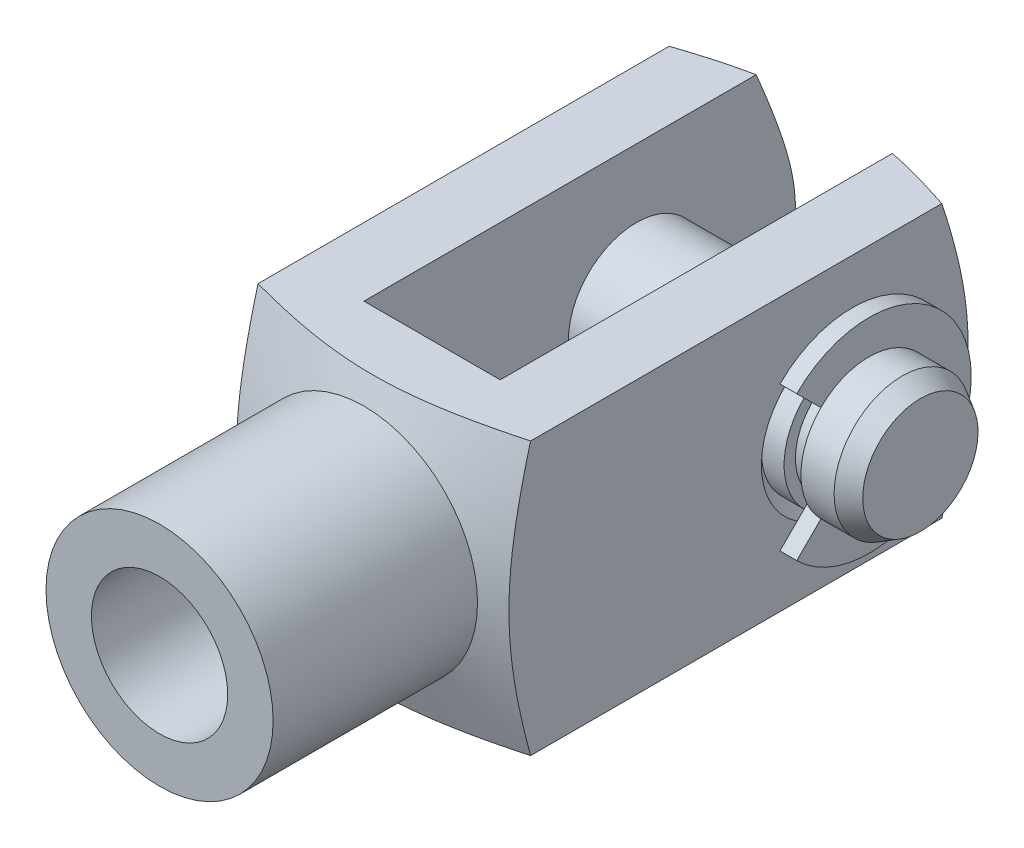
ISO-10303-21;
HEADER;
FILE_DESCRIPTION(('STEP AP214'),'2;1');
FILE_NAME('part.step','',(''),(''),'','','');
FILE_SCHEMA(('AUTOMOTIVE_DESIGN { 1 0 10303 214 1 1 1 1 }'));
ENDSEC;
DATA;
#1=APPLICATION_CONTEXT('core data for automotive mechanical design processes');
#2=APPLICATION_PROTOCOL_DEFINITION('international standard','automotive_design',2000,#1);
#3=PRODUCT_CONTEXT('',#1,'mechanical');
#4=PRODUCT('Part','Part','',(#3));
#5=PRODUCT_RELATED_PRODUCT_CATEGORY('part','',(#4));
#6=PRODUCT_DEFINITION_FORMATION('','',#4);
#7=PRODUCT_DEFINITION_CONTEXT('part definition',#1,'design');
#8=PRODUCT_DEFINITION('design','',#6,#7);
#9=PRODUCT_DEFINITION_SHAPE('','',#8);
#10=(LENGTH_UNIT() NAMED_UNIT(*) SI_UNIT(.MILLI.,.METRE.));
#11=(NAMED_UNIT(*) PLANE_ANGLE_UNIT() SI_UNIT($,.RADIAN.));
#12=(NAMED_UNIT(*) SI_UNIT($,.STERADIAN.) SOLID_ANGLE_UNIT());
#13=UNCERTAINTY_MEASURE_WITH_UNIT(LENGTH_MEASURE(1.E-05),#10,'distance_accuracy_value','');
#14=(GEOMETRIC_REPRESENTATION_CONTEXT(3) GLOBAL_UNCERTAINTY_ASSIGNED_CONTEXT((#13)) GLOBAL_UNIT_ASSIGNED_CONTEXT((#10,
#11,#12)) REPRESENTATION_CONTEXT('',''));
#15=CARTESIAN_POINT('',(0.,0.,0.));
#16=DIRECTION('',(0.,0.,1.));
#17=DIRECTION('',(1.,0.,0.));
#18=AXIS2_PLACEMENT_3D('',#15,#16,#17);
#19=CARTESIAN_POINT('',(7.24,0.,0.));
#20=DIRECTION('',(1.,0.,0.));
#21=DIRECTION('',(0.,-1.,0.));
#22=AXIS2_PLACEMENT_3D('',#19,#20,#21);
#23=PLANE('',#22);
#24=DIRECTION('',(0.,-0.707106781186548,-0.707106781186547));
#25=VECTOR('',#24,1.);
#26=CARTESIAN_POINT('',(7.24,5.30330085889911,5.3033008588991));
#27=LINE('',#26,#25);
#28=CARTESIAN_POINT('',(7.24,3.18198051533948,3.18198051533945));
#29=VERTEX_POINT('',#28);
#30=CARTESIAN_POINT('',(7.24,2.12132034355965,2.12132034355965));
#31=VERTEX_POINT('',#30);
#32=EDGE_CURVE('E613',#29,#31,#27,.T.);
#33=ORIENTED_EDGE('',*,*,#32,.T.);
#34=CARTESIAN_POINT('',(7.24,0.,0.));
#35=DIRECTION('',(1.,0.,0.));
#36=DIRECTION('',(0.,0.,-1.));
#37=AXIS2_PLACEMENT_3D('',#34,#35,#36);
#38=CIRCLE('',#37,3.);
#39=CARTESIAN_POINT('',(7.24,-2.12132034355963,2.12132034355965));
#40=VERTEX_POINT('',#39);
#41=EDGE_CURVE('E9',#40,#31,#38,.T.);
#42=ORIENTED_EDGE('',*,*,#41,.F.);
#43=DIRECTION('',(0.,-0.707106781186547,0.707106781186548));
#44=VECTOR('',#43,1.);
#45=CARTESIAN_POINT('',(7.24,-1.76776695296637,1.7677669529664));
#46=LINE('',#45,#44);
#47=CARTESIAN_POINT('',(7.24,-3.18198051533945,3.1819805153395));
#48=VERTEX_POINT('',#47);
#49=EDGE_CURVE('E633',#40,#48,#46,.T.);
#50=ORIENTED_EDGE('',*,*,#49,.T.);
#51=CARTESIAN_POINT('',(7.24,0.,0.));
#52=DIRECTION('',(-1.,0.,0.));
#53=DIRECTION('',(0.,1.,0.));
#54=AXIS2_PLACEMENT_3D('',#51,#52,#53);
#55=CIRCLE('',#54,4.5);
#56=EDGE_CURVE('E618',#29,#48,#55,.T.);
#57=ORIENTED_EDGE('',*,*,#56,.F.);
#58=EDGE_LOOP('',(#33,#42,#50,#57));
#59=FACE_BOUND('',#58,.T.);
#60=ADVANCED_FACE('F15',(#59),#23,.T.);
#61=CARTESIAN_POINT('',(6.5,-1.76776695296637,1.7677669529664));
#62=DIRECTION('',(0.,-0.707106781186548,-0.707106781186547));
#63=DIRECTION('',(0.,-0.707106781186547,0.707106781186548));
#64=AXIS2_PLACEMENT_3D('',#61,#62,#63);
#65=PLANE('',#64);
#66=CARTESIAN_POINT('',(7.24,-1.76776695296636,1.7677669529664));
#67=VERTEX_POINT('',#66);
#68=EDGE_CURVE('E34',#67,#40,#46,.T.);
#69=ORIENTED_EDGE('',*,*,#68,.F.);
#70=DIRECTION('',(-1.,0.,0.));
#71=VECTOR('',#70,1.);
#72=CARTESIAN_POINT('',(6.5,-1.76776695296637,1.7677669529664));
#73=LINE('',#72,#71);
#74=CARTESIAN_POINT('',(6.5,-1.76776695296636,1.7677669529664));
#75=VERTEX_POINT('',#74);
#76=EDGE_CURVE('E173',#75,#67,#73,.F.);
#77=ORIENTED_EDGE('',*,*,#76,.F.);
#78=DIRECTION('',(0.,-0.707106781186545,0.70710678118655));
#79=VECTOR('',#78,1.);
#80=CARTESIAN_POINT('',(6.5,-1.76776695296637,1.7677669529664));
#81=LINE('',#80,#79);
#82=CARTESIAN_POINT('',(6.5,-2.12132034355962,2.12132034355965));
#83=VERTEX_POINT('',#82);
#84=EDGE_CURVE('E638',#75,#83,#81,.T.);
#85=ORIENTED_EDGE('',*,*,#84,.T.);
#86=CARTESIAN_POINT('',(6.5,-3.18198051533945,3.1819805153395));
#87=VERTEX_POINT('',#86);
#88=EDGE_CURVE('E646',#83,#87,#81,.T.);
#89=ORIENTED_EDGE('',*,*,#88,.T.);
#90=DIRECTION('',(-1.,0.,0.));
#91=VECTOR('',#90,1.);
#92=CARTESIAN_POINT('',(6.5,-3.18198051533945,3.1819805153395));
#93=LINE('',#92,#91);
#94=EDGE_CURVE('E632',#48,#87,#93,.T.);
#95=ORIENTED_EDGE('',*,*,#94,.F.);
#96=ORIENTED_EDGE('',*,*,#49,.F.);
#97=EDGE_LOOP('',(#69,#77,#85,#89,#95,#96));
#98=FACE_BOUND('',#97,.T.);
#99=ADVANCED_FACE('F585',(#98),#65,.F.);
#100=CARTESIAN_POINT('',(6.5,0.,0.));
#101=DIRECTION('',(-1.,0.,0.));
#102=DIRECTION('',(0.,1.,0.));
#103=AXIS2_PLACEMENT_3D('',#100,#101,#102);
#104=CYLINDRICAL_SURFACE('',#103,4.5);
#105=DIRECTION('',(-1.,0.,0.));
#106=VECTOR('',#105,1.);
#107=CARTESIAN_POINT('',(6.5,3.18198051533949,3.1819805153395));
#108=LINE('',#107,#106);
#109=CARTESIAN_POINT('',(6.5,3.18198051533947,3.1819805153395));
#110=VERTEX_POINT('',#109);
#111=EDGE_CURVE('E625',#110,#29,#108,.F.);
#112=ORIENTED_EDGE('',*,*,#111,.T.);
#113=ORIENTED_EDGE('',*,*,#56,.T.);
#114=ORIENTED_EDGE('',*,*,#94,.T.);
#115=CARTESIAN_POINT('',(6.5,0.,0.));
#116=DIRECTION('',(-1.,0.,0.));
#117=DIRECTION('',(0.,1.,0.));
#118=AXIS2_PLACEMENT_3D('',#115,#116,#117);
#119=CIRCLE('',#118,4.5);
#120=EDGE_CURVE('E634',#87,#110,#119,.F.);
#121=ORIENTED_EDGE('',*,*,#120,.T.);
#122=EDGE_LOOP('',(#112,#113,#114,#121));
#123=FACE_BOUND('',#122,.T.);
#124=ADVANCED_FACE('F575',(#123),#104,.T.);
#125=CARTESIAN_POINT('',(6.5,5.30330085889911,5.3033008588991));
#126=DIRECTION('',(0.,0.707106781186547,-0.707106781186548));
#127=DIRECTION('',(0.,-0.707106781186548,-0.707106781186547));
#128=AXIS2_PLACEMENT_3D('',#125,#126,#127);
#129=PLANE('',#128);
#130=DIRECTION('',(0.,-0.707106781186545,-0.70710678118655));
#131=VECTOR('',#130,1.);
#132=CARTESIAN_POINT('',(6.5,3.18198051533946,3.1819805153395));
#133=LINE('',#132,#131);
#134=CARTESIAN_POINT('',(6.5,2.12132034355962,2.12132034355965));
#135=VERTEX_POINT('',#134);
#136=EDGE_CURVE('E649',#110,#135,#133,.T.);
#137=ORIENTED_EDGE('',*,*,#136,.T.);
#138=CARTESIAN_POINT('',(6.5,1.76776695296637,1.7677669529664));
#139=VERTEX_POINT('',#138);
#140=EDGE_CURVE('E637',#135,#139,#133,.T.);
#141=ORIENTED_EDGE('',*,*,#140,.T.);
#142=DIRECTION('',(-1.,0.,0.));
#143=VECTOR('',#142,1.);
#144=CARTESIAN_POINT('',(6.5,1.76776695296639,1.7677669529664));
#145=LINE('',#144,#143);
#146=CARTESIAN_POINT('',(7.24,1.76776695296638,1.76776695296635));
#147=VERTEX_POINT('',#146);
#148=EDGE_CURVE('E622',#147,#139,#145,.T.);
#149=ORIENTED_EDGE('',*,*,#148,.F.);
#150=EDGE_CURVE('E623',#31,#147,#27,.T.);
#151=ORIENTED_EDGE('',*,*,#150,.F.);
#152=ORIENTED_EDGE('',*,*,#32,.F.);
#153=ORIENTED_EDGE('',*,*,#111,.F.);
#154=EDGE_LOOP('',(#137,#141,#149,#151,#152,#153));
#155=FACE_BOUND('',#154,.T.);
#156=ADVANCED_FACE('F565',(#155),#129,.F.);
#157=CARTESIAN_POINT('',(6.5,0.,0.));
#158=DIRECTION('',(1.,0.,0.));
#159=DIRECTION('',(0.,-1.,0.));
#160=AXIS2_PLACEMENT_3D('',#157,#158,#159);
#161=PLANE('',#160);
#162=CARTESIAN_POINT('',(6.5,0.,0.));
#163=DIRECTION('',(1.,0.,0.));
#164=DIRECTION('',(0.,-1.,0.));
#165=AXIS2_PLACEMENT_3D('',#162,#163,#164);
#166=CIRCLE('',#165,3.);
#167=EDGE_CURVE('E25',#135,#83,#166,.F.);
#168=ORIENTED_EDGE('',*,*,#167,.F.);
#169=ORIENTED_EDGE('',*,*,#136,.F.);
#170=ORIENTED_EDGE('',*,*,#120,.F.);
#171=ORIENTED_EDGE('',*,*,#88,.F.);
#172=EDGE_LOOP('',(#168,#169,#170,#171));
#173=FACE_BOUND('',#172,.T.);
#174=ADVANCED_FACE('F382',(#173),#161,.F.);
#175=CARTESIAN_POINT('',(-7.5,0.,2.));
#176=DIRECTION('',(-1.,0.,0.));
#177=DIRECTION('',(0.,1.,0.));
#178=AXIS2_PLACEMENT_3D('',#175,#176,#177);
#179=PLANE('',#178);
#180=CARTESIAN_POINT('',(-7.50000000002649,0.,0.));
#181=DIRECTION('',(1.,0.,0.));
#182=DIRECTION('',(0.,-1.,0.));
#183=AXIS2_PLACEMENT_3D('',#180,#181,#182);
#184=CIRCLE('',#183,3.99999999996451);
#185=CARTESIAN_POINT('',(-7.50000000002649,-3.99999999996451,0.));
#186=VERTEX_POINT('',#185);
#187=EDGE_CURVE('E156',#186,#186,#184,.T.);
#188=ORIENTED_EDGE('',*,*,#187,.F.);
#189=EDGE_LOOP('',(#188));
#190=FACE_BOUND('',#189,.T.);
#191=ADVANCED_FACE('F377',(#190),#179,.T.);
#192=CARTESIAN_POINT('',(-7.00000000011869,0.,0.));
#193=DIRECTION('',(1.,0.,0.));
#194=DIRECTION('',(0.,-1.,0.));
#195=AXIS2_PLACEMENT_3D('',#192,#193,#194);
#196=CONICAL_SURFACE('',#195,4.49999999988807,0.785398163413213);
#197=ORIENTED_EDGE('',*,*,#187,.T.);
#198=EDGE_LOOP('',(#197));
#199=FACE_BOUND('',#198,.T.);
#200=CARTESIAN_POINT('',(-7.,0.,0.));
#201=DIRECTION('',(1.,0.,0.));
#202=DIRECTION('',(0.,-1.,0.));
#203=AXIS2_PLACEMENT_3D('',#200,#201,#202);
#204=CIRCLE('',#203,4.5);
#205=CARTESIAN_POINT('',(-7.,-4.5,0.));
#206=VERTEX_POINT('',#205);
#207=EDGE_CURVE('E153',#206,#206,#204,.T.);
#208=ORIENTED_EDGE('',*,*,#207,.F.);
#209=EDGE_LOOP('',(#208));
#210=FACE_BOUND('',#209,.T.);
#211=ADVANCED_FACE('F375',(#199,#210),#196,.T.);
#212=CARTESIAN_POINT('',(0.,2.5,24.));
#213=DIRECTION('',(0.,0.,1.));
#214=DIRECTION('',(1.,0.,0.));
#215=AXIS2_PLACEMENT_3D('',#212,#213,#214);
#216=PLANE('',#215);
#217=CARTESIAN_POINT('',(0.,0.,24.));
#218=DIRECTION('',(0.,0.,1.));
#219=DIRECTION('',(1.,0.,0.));
#220=AXIS2_PLACEMENT_3D('',#217,#218,#219);
#221=CIRCLE('',#220,5.);
#222=CARTESIAN_POINT('',(5.,0.,24.));
#223=VERTEX_POINT('',#222);
#224=EDGE_CURVE('E473',#223,#223,#221,.F.);
#225=ORIENTED_EDGE('',*,*,#224,.F.);
#226=EDGE_LOOP('',(#225));
#227=FACE_BOUND('',#226,.T.);
#228=CARTESIAN_POINT('',(0.,0.,23.9999999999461));
#229=DIRECTION('',(0.,0.,1.));
#230=DIRECTION('',(1.,0.,0.));
#231=AXIS2_PLACEMENT_3D('',#228,#229,#230);
#232=CIRCLE('',#231,2.99999999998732);
#233=CARTESIAN_POINT('',(2.99999999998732,0.,23.9999999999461));
#234=VERTEX_POINT('',#233);
#235=EDGE_CURVE('E132',#234,#234,#232,.F.);
#236=ORIENTED_EDGE('',*,*,#235,.T.);
#237=EDGE_LOOP('',(#236));
#238=FACE_BOUND('',#237,.T.);
#239=ADVANCED_FACE('F17',(#227,#238),#216,.T.);
#240=CARTESIAN_POINT('',(0.,0.,19.5));
#241=DIRECTION('',(0.,0.,1.));
#242=DIRECTION('',(1.,0.,0.));
#243=AXIS2_PLACEMENT_3D('',#240,#241,#242);
#244=CYLINDRICAL_SURFACE('',#243,5.);
#245=ORIENTED_EDGE('',*,*,#224,.T.);
#246=EDGE_LOOP('',(#245));
#247=FACE_BOUND('',#246,.T.);
#248=CARTESIAN_POINT('',(0.,0.,15.));
#249=DIRECTION('',(0.,0.,-1.));
#250=DIRECTION('',(0.,1.,0.));
#251=AXIS2_PLACEMENT_3D('',#248,#249,#250);
#252=CIRCLE('',#251,5.);
#253=CARTESIAN_POINT('',(0.,5.,15.));
#254=VERTEX_POINT('',#253);
#255=EDGE_CURVE('E225',#254,#254,#252,.T.);
#256=ORIENTED_EDGE('',*,*,#255,.F.);
#257=EDGE_LOOP('',(#256));
#258=FACE_BOUND('',#257,.T.);
#259=ADVANCED_FACE('F391',(#247,#258),#244,.T.);
#260=CARTESIAN_POINT('',(-6.5,0.,0.));
#261=DIRECTION('',(1.,0.,0.));
#262=DIRECTION('',(0.,-1.,0.));
#263=AXIS2_PLACEMENT_3D('',#260,#261,#262);
#264=CYLINDRICAL_SURFACE('',#263,4.5);
#265=ORIENTED_EDGE('',*,*,#207,.T.);
#266=EDGE_LOOP('',(#265));
#267=FACE_BOUND('',#266,.T.);
#268=CARTESIAN_POINT('',(-6.,0.,0.));
#269=DIRECTION('',(1.,0.,0.));
#270=DIRECTION('',(0.,-1.,0.));
#271=AXIS2_PLACEMENT_3D('',#268,#269,#270);
#272=CIRCLE('',#271,4.5);
#273=CARTESIAN_POINT('',(-6.,-4.5,0.));
#274=VERTEX_POINT('',#273);
#275=EDGE_CURVE('E138',#274,#274,#272,.T.);
#276=ORIENTED_EDGE('',*,*,#275,.F.);
#277=EDGE_LOOP('',(#276));
#278=FACE_BOUND('',#277,.T.);
#279=ADVANCED_FACE('F361',(#267,#278),#264,.T.);
#280=CARTESIAN_POINT('',(0.,0.,3.51471862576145));
#281=DIRECTION('',(0.,0.,1.));
#282=DIRECTION('',(1.,0.,0.));
#283=AXIS2_PLACEMENT_3D('',#280,#281,#282);
#284=CYLINDRICAL_SURFACE('',#283,3.);
#285=CARTESIAN_POINT('',(0.,0.,12.000000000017));
#286=DIRECTION('',(0.,0.,-1.));
#287=DIRECTION('',(-1.,0.,0.));
#288=AXIS2_PLACEMENT_3D('',#285,#286,#287);
#289=CIRCLE('',#288,3.0000000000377);
#290=CARTESIAN_POINT('',(-3.,0.,12.));
#291=VERTEX_POINT('',#290);
#292=CARTESIAN_POINT('',(3.00000000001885,0.,12.0000000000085));
#293=VERTEX_POINT('',#292);
#294=EDGE_CURVE('E220',#291,#293,#289,.T.);
#295=ORIENTED_EDGE('',*,*,#294,.T.);
#296=CARTESIAN_POINT('',(0.,0.,12.000000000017));
#297=DIRECTION('',(0.,0.,-1.));
#298=DIRECTION('',(-1.,0.,0.));
#299=AXIS2_PLACEMENT_3D('',#296,#297,#298);
#300=CIRCLE('',#299,3.0000000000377);
#301=EDGE_CURVE('E211',#293,#291,#300,.T.);
#302=ORIENTED_EDGE('',*,*,#301,.T.);
#303=EDGE_LOOP('',(#295,#302));
#304=FACE_BOUND('',#303,.T.);
#305=ORIENTED_EDGE('',*,*,#235,.F.);
#306=EDGE_LOOP('',(#305));
#307=FACE_BOUND('',#306,.T.);
#308=ADVANCED_FACE('F255',(#304,#307),#284,.F.);
#309=CARTESIAN_POINT('',(0.5,0.,0.));
#310=DIRECTION('',(1.,0.,0.));
#311=DIRECTION('',(0.,-1.,0.));
#312=AXIS2_PLACEMENT_3D('',#309,#310,#311);
#313=CYLINDRICAL_SURFACE('',#312,3.);
#314=CARTESIAN_POINT('',(3.,0.,0.));
#315=DIRECTION('',(1.,0.,0.));
#316=DIRECTION('',(0.,0.,-1.));
#317=AXIS2_PLACEMENT_3D('',#314,#315,#316);
#318=CIRCLE('',#317,3.);
#319=CARTESIAN_POINT('',(3.,0.,-3.));
#320=VERTEX_POINT('',#319);
#321=EDGE_CURVE('E170',#320,#320,#318,.F.);
#322=ORIENTED_EDGE('',*,*,#321,.T.);
#323=EDGE_LOOP('',(#322));
#324=FACE_BOUND('',#323,.T.);
#325=CARTESIAN_POINT('',(-3.,0.,0.));
#326=DIRECTION('',(-1.,0.,0.));
#327=DIRECTION('',(0.,0.,1.));
#328=AXIS2_PLACEMENT_3D('',#325,#326,#327);
#329=CIRCLE('',#328,3.);
#330=CARTESIAN_POINT('',(-3.,0.,3.));
#331=VERTEX_POINT('',#330);
#332=EDGE_CURVE('E167',#331,#331,#329,.F.);
#333=ORIENTED_EDGE('',*,*,#332,.T.);
#334=EDGE_LOOP('',(#333));
#335=FACE_BOUND('',#334,.T.);
#336=ADVANCED_FACE('F344',(#324,#335),#313,.T.);
#337=CARTESIAN_POINT('',(-3.,20.,12.));
#338=DIRECTION('',(0.,0.,1.));
#339=DIRECTION('',(1.,0.,0.));
#340=AXIS2_PLACEMENT_3D('',#337,#338,#339);
#341=PLANE('',#340);
#342=ORIENTED_EDGE('',*,*,#301,.F.);
#343=DIRECTION('',(0.,1.,0.));
#344=VECTOR('',#343,1.);
#345=CARTESIAN_POINT('',(3.,20.,12.));
#346=LINE('',#345,#344);
#347=CARTESIAN_POINT('',(3.,-6.,12.));
#348=VERTEX_POINT('',#347);
#349=EDGE_CURVE('E214',#348,#293,#346,.T.);
#350=ORIENTED_EDGE('',*,*,#349,.F.);
#351=DIRECTION('',(1.,0.,0.));
#352=VECTOR('',#351,1.);
#353=CARTESIAN_POINT('',(-20.,-6.,12.));
#354=LINE('',#353,#352);
#355=CARTESIAN_POINT('',(-3.,-6.,12.));
#356=VERTEX_POINT('',#355);
#357=EDGE_CURVE('E189',#348,#356,#354,.F.);
#358=ORIENTED_EDGE('',*,*,#357,.T.);
#359=DIRECTION('',(0.,1.,0.));
#360=VECTOR('',#359,1.);
#361=CARTESIAN_POINT('',(-3.,20.,12.));
#362=LINE('',#361,#360);
#363=EDGE_CURVE('E207',#356,#291,#362,.T.);
#364=ORIENTED_EDGE('',*,*,#363,.T.);
#365=EDGE_LOOP('',(#342,#350,#358,#364));
#366=FACE_BOUND('',#365,.T.);
#367=ADVANCED_FACE('F333',(#366),#341,.F.);
#368=CARTESIAN_POINT('',(0.,0.,13.6540985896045));
#369=DIRECTION('',(0.,0.,-1.));
#370=DIRECTION('',(-1.,0.,0.));
#371=AXIS2_PLACEMENT_3D('',#368,#369,#370);
#372=CONICAL_SURFACE('',#371,8.50619304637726,1.20427718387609);
#373=ORIENTED_EDGE('',*,*,#255,.T.);
#374=EDGE_LOOP('',(#373));
#375=FACE_BOUND('',#374,.T.);
#376=CARTESIAN_POINT('',(-6.,5.99999999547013,13.6621258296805));
#377=CARTESIAN_POINT('',(-6.,5.85674586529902,13.701007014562));
#378=CARTESIAN_POINT('',(-6.,5.71331730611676,13.7392450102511));
#379=CARTESIAN_POINT('',(-6.,5.42607293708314,13.8142618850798));
#380=CARTESIAN_POINT('',(-6.,5.28225711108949,13.8510407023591));
#381=CARTESIAN_POINT('',(-6.,4.8500389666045,13.9589619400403));
#382=CARTESIAN_POINT('',(-6.,4.56101551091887,14.027648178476));
#383=CARTESIAN_POINT('',(-6.,3.97957524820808,14.1570816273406));
#384=CARTESIAN_POINT('',(-6.,3.68714857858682,14.2177849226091));
#385=CARTESIAN_POINT('',(-6.,3.10032390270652,14.3286832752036));
#386=CARTESIAN_POINT('',(-6.,2.80592618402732,14.3788798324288));
#387=CARTESIAN_POINT('',(-6.,2.22342048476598,14.4651854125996));
#388=CARTESIAN_POINT('',(-6.,1.93536571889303,14.5016478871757));
#389=CARTESIAN_POINT('',(-6.,1.35778567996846,14.5603162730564));
#390=CARTESIAN_POINT('',(-6.,1.06826045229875,14.582522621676));
#391=CARTESIAN_POINT('',(-6.,0.489179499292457,14.6111151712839));
#392=CARTESIAN_POINT('',(-6.,0.199625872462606,14.6175429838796));
#393=CARTESIAN_POINT('',(-6.,-0.379381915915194,14.6142121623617));
#394=CARTESIAN_POINT('',(-6.,-0.66883608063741,14.6044541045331));
#395=CARTESIAN_POINT('',(-6.,-1.16903579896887,14.574197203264));
#396=CARTESIAN_POINT('',(-6.,-1.38000947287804,14.5572935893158));
#397=CARTESIAN_POINT('',(-6.,-1.80121283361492,14.5158610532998));
#398=CARTESIAN_POINT('',(-6.,-2.01144246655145,14.4913315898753));
#399=CARTESIAN_POINT('',(-6.,-2.64143597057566,14.4073756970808));
#400=CARTESIAN_POINT('',(-6.,-3.05984164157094,14.3376263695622));
#401=CARTESIAN_POINT('',(-6.,-3.6887818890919,14.2166001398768));
#402=CARTESIAN_POINT('',(-6.,-3.90087266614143,14.1729794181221));
#403=CARTESIAN_POINT('',(-6.,-4.32407184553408,14.0811356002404));
#404=CARTESIAN_POINT('',(-6.,-4.53518021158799,14.0329123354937));
#405=CARTESIAN_POINT('',(-6.,-4.95573319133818,13.9327658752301));
#406=CARTESIAN_POINT('',(-6.,-5.16518103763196,13.8808561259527));
#407=CARTESIAN_POINT('',(-6.,-5.5832094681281,13.7737846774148));
#408=CARTESIAN_POINT('',(-6.,-5.79179018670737,13.7186235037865));
#409=CARTESIAN_POINT('',(-6.,-5.9999999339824,13.6621258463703));
#410=B_SPLINE_CURVE_WITH_KNOTS('',3,(#376,#377,#378,#379,#380,#381,#382,#383,#384,#385,#386,
#387,#388,#389,#390,#391,#392,#393,#394,#395,#396,#397,#398,#399,#400,#401,#402,#403,#404,#405,
#406,#407,#408,#409),.UNSPECIFIED.,.F.,.F.,(4,2,2,2,2,2,2,2,2,2,2,2,2,2,2,2,4),(0.,
0.445307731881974,0.890634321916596,1.7817525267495,2.67758429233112,3.57328808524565,
4.44404276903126,5.31477074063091,6.1831999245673,7.05159818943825,7.68640517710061,
8.32125723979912,9.5929500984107,10.2425125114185,10.8920987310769,11.5394265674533,
12.1866500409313),.UNSPECIFIED.);
#411=CARTESIAN_POINT('',(-6.,5.99999999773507,13.6621258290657));
#412=VERTEX_POINT('',#411);
#413=CARTESIAN_POINT('',(-5.99999999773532,-5.9999999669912,13.6621258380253));
#414=VERTEX_POINT('',#413);
#415=EDGE_CURVE('E228',#412,#414,#410,.T.);
#416=ORIENTED_EDGE('',*,*,#415,.T.);
#417=CARTESIAN_POINT('',(-5.99999998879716,-5.99999996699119,13.6621258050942));
#418=CARTESIAN_POINT('',(-5.75268333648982,-5.99999998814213,13.7292210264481));
#419=CARTESIAN_POINT('',(-5.50483949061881,-5.99999999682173,13.7944515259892));
#420=CARTESIAN_POINT('',(-5.00787439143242,-6.00000000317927,13.9201779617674));
#421=CARTESIAN_POINT('',(-4.75875276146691,-6.00000000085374,13.9806724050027));
#422=CARTESIAN_POINT('',(-4.2579522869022,-5.99999999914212,14.0961576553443));
#423=CARTESIAN_POINT('',(-4.00626689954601,-5.99999999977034,14.1511203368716));
#424=CARTESIAN_POINT('',(-3.50144874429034,-6.00000000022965,14.2539006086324));
#425=CARTESIAN_POINT('',(-3.24831609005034,-6.00000000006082,14.3017187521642));
#426=CARTESIAN_POINT('',(-2.74689282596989,-5.99999999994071,14.3876678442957));
#427=CARTESIAN_POINT('',(-2.49863892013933,-5.99999999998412,14.4260106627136));
#428=CARTESIAN_POINT('',(-2.00082116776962,-6.00000000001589,14.4930988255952));
#429=CARTESIAN_POINT('',(-1.75125732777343,-6.00000000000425,14.5218442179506));
#430=CARTESIAN_POINT('',(-1.25169135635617,-5.99999999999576,14.5683856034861));
#431=CARTESIAN_POINT('',(-1.00169166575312,-5.99999999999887,14.5862073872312));
#432=CARTESIAN_POINT('',(-0.501127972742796,-6.00000000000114,14.6100824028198));
#433=CARTESIAN_POINT('',(-0.250563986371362,-6.0000000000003,14.6161359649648));
#434=CARTESIAN_POINT('',(0.250563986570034,-5.9999999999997,14.6161359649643));
#435=CARTESIAN_POINT('',(0.501127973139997,-5.99999999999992,14.6100824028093));
#436=CARTESIAN_POINT('',(1.0016916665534,-6.00000000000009,14.5862073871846));
#437=CARTESIAN_POINT('',(1.25169135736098,-6.00000000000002,14.5683856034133));
#438=CARTESIAN_POINT('',(1.75125732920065,-5.99999999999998,14.5218442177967));
#439=CARTESIAN_POINT('',(2.00082116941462,-6.,14.4930988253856));
#440=CARTESIAN_POINT('',(2.4986389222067,-6.00000000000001,14.4260106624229));
#441=CARTESIAN_POINT('',(2.74689282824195,-6.00000000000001,14.3876678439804));
#442=CARTESIAN_POINT('',(3.24831609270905,-6.,14.3017187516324));
#443=CARTESIAN_POINT('',(3.50144874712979,-6.,14.2539006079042));
#444=CARTESIAN_POINT('',(4.00626690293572,-6.,14.1511203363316));
#445=CARTESIAN_POINT('',(4.25795229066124,-6.,14.0961576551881));
#446=CARTESIAN_POINT('',(4.75875276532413,-6.,13.9806724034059));
#447=CARTESIAN_POINT('',(5.00787439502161,-6.,13.9201779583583));
#448=CARTESIAN_POINT('',(5.50483949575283,-6.,13.794451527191));
#449=CARTESIAN_POINT('',(5.75268334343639,-6.,13.7292210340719));
#450=CARTESIAN_POINT('',(6.,-6.,13.662125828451));
#451=B_SPLINE_CURVE_WITH_KNOTS('',3,(#417,#418,#419,#420,#421,#422,#423,#424,#425,#426,#427,
#428,#429,#430,#431,#432,#433,#434,#435,#436,#437,#438,#439,#440,#441,#442,#443,#444,#445,#446,
#447,#448,#449,#450),.UNSPECIFIED.,.F.,.F.,(4,2,2,2,2,2,2,2,2,2,2,2,2,2,2,2,4),(0.,
0.768792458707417,1.53782630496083,2.31059122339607,3.08329626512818,3.83672853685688,
4.59015704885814,5.34179979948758,6.09342145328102,6.84504310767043,7.59668585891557,
8.35011437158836,9.10354664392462,9.87625168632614,10.6490166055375,11.4180504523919,
12.1868429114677),.UNSPECIFIED.);
#452=CARTESIAN_POINT('',(6.,-6.,13.662125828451));
#453=VERTEX_POINT('',#452);
#454=EDGE_CURVE('E184',#414,#453,#451,.T.);
#455=ORIENTED_EDGE('',*,*,#454,.T.);
#456=CARTESIAN_POINT('',(6.,-6.,13.662125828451));
#457=CARTESIAN_POINT('',(6.,-5.85674586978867,13.701007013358));
#458=CARTESIAN_POINT('',(6.,-5.71331731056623,13.7392450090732));
#459=CARTESIAN_POINT('',(6.,-5.42607294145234,13.8142618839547));
#460=CARTESIAN_POINT('',(6.,-5.28225711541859,13.8510407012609));
#461=CARTESIAN_POINT('',(6.,-4.85003897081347,13.9589619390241));
#462=CARTESIAN_POINT('',(6.,-4.56101551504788,14.0276481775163));
#463=CARTESIAN_POINT('',(6.,-3.9795752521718,14.1570816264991));
#464=CARTESIAN_POINT('',(6.,-3.68714858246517,14.2177849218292));
#465=CARTESIAN_POINT('',(6.,-3.10032390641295,14.32868327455));
#466=CARTESIAN_POINT('',(6.,-2.80592618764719,14.3788798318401));
#467=CARTESIAN_POINT('',(6.,-2.22342048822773,14.4651854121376));
#468=CARTESIAN_POINT('',(6.,-1.93536572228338,14.5016478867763));
#469=CARTESIAN_POINT('',(6.,-1.35778568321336,14.5603162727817));
#470=CARTESIAN_POINT('',(6.,-1.06826045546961,14.5825226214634));
#471=CARTESIAN_POINT('',(6.,-0.489179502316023,14.6111151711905));
#472=CARTESIAN_POINT('',(6.,-0.199625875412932,14.6175429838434));
#473=CARTESIAN_POINT('',(6.,0.379381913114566,14.6142121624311));
#474=CARTESIAN_POINT('',(6.,0.668836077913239,14.6044541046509));
#475=CARTESIAN_POINT('',(6.,1.16903579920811,14.5741972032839));
#476=CARTESIAN_POINT('',(6.,1.38000947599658,14.5572935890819));
#477=CARTESIAN_POINT('',(6.,1.80121284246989,14.5158610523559));
#478=CARTESIAN_POINT('',(6.,2.01144247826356,14.4913315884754));
#479=CARTESIAN_POINT('',(6.,2.64143599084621,14.4073756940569));
#480=CARTESIAN_POINT('',(6.,3.05984166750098,14.3376263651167));
#481=CARTESIAN_POINT('',(6.,3.68878192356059,14.2166001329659));
#482=CARTESIAN_POINT('',(6.,3.9008727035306,14.172979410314));
#483=CARTESIAN_POINT('',(6.,4.32407188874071,14.0811355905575));
#484=CARTESIAN_POINT('',(6.,4.53518025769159,14.0329123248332));
#485=CARTESIAN_POINT('',(6.,4.9557332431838,13.9327658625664));
#486=CARTESIAN_POINT('',(6.,5.16518109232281,13.8808561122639));
#487=CARTESIAN_POINT('',(6.,5.58320952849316,13.7737846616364));
#488=CARTESIAN_POINT('',(6.,5.79179024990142,13.7186234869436));
#489=CARTESIAN_POINT('',(6.,6.,13.662125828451));
#490=B_SPLINE_CURVE_WITH_KNOTS('',3,(#456,#457,#458,#459,#460,#461,#462,#463,#464,#465,#466,
#467,#468,#469,#470,#471,#472,#473,#474,#475,#476,#477,#478,#479,#480,#481,#482,#483,#484,#485,
#486,#487,#488,#489),.UNSPECIFIED.,.F.,.F.,(4,2,2,2,2,2,2,2,2,2,2,2,2,2,2,2,4),(0.,
0.445307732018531,0.890634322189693,1.78175252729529,2.6775842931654,3.57328808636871,
4.44404277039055,5.31477074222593,6.18319992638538,7.05159819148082,7.68640518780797,
8.32125725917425,9.59295013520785,10.2425125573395,10.8920987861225,11.5394266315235,
12.1866501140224),.UNSPECIFIED.);
#491=CARTESIAN_POINT('',(6.,6.,13.662125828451));
#492=VERTEX_POINT('',#491);
#493=EDGE_CURVE('E180',#453,#492,#490,.T.);
#494=ORIENTED_EDGE('',*,*,#493,.T.);
#495=CARTESIAN_POINT('',(6.,6.,13.662125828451));
#496=CARTESIAN_POINT('',(5.75268334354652,6.,13.7292210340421));
#497=CARTESIAN_POINT('',(5.50483949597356,6.,13.7944515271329));
#498=CARTESIAN_POINT('',(5.00787439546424,6.,13.9201779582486));
#499=CARTESIAN_POINT('',(4.75875276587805,6.,13.9806724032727));
#500=CARTESIAN_POINT('',(4.25795229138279,6.,14.0961576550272));
#501=CARTESIAN_POINT('',(4.00626690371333,6.,14.1511203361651));
#502=CARTESIAN_POINT('',(3.50144874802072,6.,14.253900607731));
#503=CARTESIAN_POINT('',(3.24831609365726,6.,14.3017187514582));
#504=CARTESIAN_POINT('',(2.74689282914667,6.,14.3876678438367));
#505=CARTESIAN_POINT('',(2.49863892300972,6.,14.4260106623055));
#506=CARTESIAN_POINT('',(2.00082117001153,6.,14.4930988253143));
#507=CARTESIAN_POINT('',(1.75125732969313,6.,14.5218442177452));
#508=CARTESIAN_POINT('',(1.25169135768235,6.,14.568385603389));
#509=CARTESIAN_POINT('',(1.00169166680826,6.,14.5862073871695));
#510=CARTESIAN_POINT('',(0.501127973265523,6.,14.6100824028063));
#511=CARTESIAN_POINT('',(0.250563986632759,6.,14.6161359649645));
#512=CARTESIAN_POINT('',(-0.250563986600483,6.,14.6161359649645));
#513=CARTESIAN_POINT('',(-0.501127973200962,6.,14.6100824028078));
#514=CARTESIAN_POINT('',(-1.00169166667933,6.,14.5862073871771));
#515=CARTESIAN_POINT('',(-1.25169135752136,6.,14.5683856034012));
#516=CARTESIAN_POINT('',(-1.75125732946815,6.,14.521844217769));
#517=CARTESIAN_POINT('',(-2.00082116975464,6.,14.4930988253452));
#518=CARTESIAN_POINT('',(-2.49863892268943,6.,14.4260106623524));
#519=CARTESIAN_POINT('',(-2.74689282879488,6.,14.3876678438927));
#520=CARTESIAN_POINT('',(-3.24831609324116,6.,14.301718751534));
#521=CARTESIAN_POINT('',(-3.50144874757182,6.,14.2539006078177));
#522=CARTESIAN_POINT('',(-4.00626690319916,6.,14.1511203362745));
#523=CARTESIAN_POINT('',(-4.25795229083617,6.,14.0961576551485));
#524=CARTESIAN_POINT('',(-4.75875276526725,6.,13.9806724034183));
#525=CARTESIAN_POINT('',(-5.00787439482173,6.,13.9201779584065));
#526=CARTESIAN_POINT('',(-5.50483949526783,6.,13.794451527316));
#527=CARTESIAN_POINT('',(-5.75268334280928,6.,13.7292210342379));
#528=CARTESIAN_POINT('',(-5.9999999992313,6.,13.6621258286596));
#529=B_SPLINE_CURVE_WITH_KNOTS('',3,(#495,#496,#497,#498,#499,#500,#501,#502,#503,#504,#505,
#506,#507,#508,#509,#510,#511,#512,#513,#514,#515,#516,#517,#518,#519,#520,#521,#522,#523,#524,
#525,#526,#527,#528),.UNSPECIFIED.,.F.,.F.,(4,2,2,2,2,2,2,2,2,2,2,2,2,2,2,2,4),(0.,
0.76879245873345,1.53782630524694,2.31059122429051,3.08329626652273,3.83672853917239,
4.59015705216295,5.34179980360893,6.09342145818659,6.84504311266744,7.59668586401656,
8.35011437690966,9.10354664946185,9.87625169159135,10.6490166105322,11.4180504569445,
12.1868429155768),.UNSPECIFIED.);
#530=EDGE_CURVE('E206',#492,#412,#529,.T.);
#531=ORIENTED_EDGE('',*,*,#530,.T.);
#532=EDGE_LOOP('',(#416,#455,#494,#531));
#533=FACE_BOUND('',#532,.T.);
#534=ADVANCED_FACE('F330',(#375,#533),#372,.T.);
#535=CARTESIAN_POINT('',(-6.,20.,36.));
#536=DIRECTION('',(1.,0.,0.));
#537=DIRECTION('',(0.,-1.,0.));
#538=AXIS2_PLACEMENT_3D('',#535,#536,#537);
#539=PLANE('',#538);
#540=ORIENTED_EDGE('',*,*,#415,.F.);
#541=DIRECTION('',(0.,0.,-1.));
#542=VECTOR('',#541,1.);
#543=CARTESIAN_POINT('',(-6.,6.,-13.2));
#544=LINE('',#543,#542);
#545=CARTESIAN_POINT('',(-5.99999999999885,5.99999999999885,-4.4421712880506));
#546=VERTEX_POINT('',#545);
#547=EDGE_CURVE('E203',#412,#546,#544,.T.);
#548=ORIENTED_EDGE('',*,*,#547,.T.);
#549=CARTESIAN_POINT('',(-6.,-5.99999999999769,-4.4421712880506));
#550=CARTESIAN_POINT('',(-6.,-5.76155030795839,-4.52075511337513));
#551=CARTESIAN_POINT('',(-6.,-5.52240263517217,-4.59730340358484));
#552=CARTESIAN_POINT('',(-6.,-5.04240998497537,-4.74522851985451));
#553=CARTESIAN_POINT('',(-6.,-4.80156435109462,-4.81660321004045));
#554=CARTESIAN_POINT('',(-6.,-4.3163592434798,-4.95349698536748));
#555=CARTESIAN_POINT('',(-6.,-4.07198696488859,-5.01897106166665));
#556=CARTESIAN_POINT('',(-6.,-3.58126973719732,-5.14201547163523));
#557=CARTESIAN_POINT('',(-6.,-3.33492499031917,-5.19958660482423));
#558=CARTESIAN_POINT('',(-6.,-2.84886563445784,-5.30329240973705));
#559=CARTESIAN_POINT('',(-6.,-2.60922231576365,-5.34975792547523));
#560=CARTESIAN_POINT('',(-6.,-2.1281067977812,-5.43213570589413));
#561=CARTESIAN_POINT('',(-6.,-1.8866346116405,-5.46804804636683));
#562=CARTESIAN_POINT('',(-6.,-1.40301377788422,-5.52765282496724));
#563=CARTESIAN_POINT('',(-6.,-1.16087038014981,-5.55138720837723));
#564=CARTESIAN_POINT('',(-6.,-0.675642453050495,-5.58561476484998));
#565=CARTESIAN_POINT('',(-6.,-0.432557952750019,-5.59610834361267));
#566=CARTESIAN_POINT('',(-6.,0.069020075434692,-5.60348286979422));
#567=CARTESIAN_POINT('',(-6.,0.327527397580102,-5.59947231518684));
#568=CARTESIAN_POINT('',(-6.,0.843844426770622,-5.57608551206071));
#569=CARTESIAN_POINT('',(-6.,1.10165409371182,-5.55670839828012));
#570=CARTESIAN_POINT('',(-6.,1.61675254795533,-5.50366316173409));
#571=CARTESIAN_POINT('',(-6.,1.87403573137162,-5.46994157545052));
#572=CARTESIAN_POINT('',(-6.,2.38662073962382,-5.38997126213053));
#573=CARTESIAN_POINT('',(-6.,2.64192253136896,-5.34372232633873));
#574=CARTESIAN_POINT('',(-6.,3.1601503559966,-5.23867862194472));
#575=CARTESIAN_POINT('',(-6.,3.4229913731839,-5.17946929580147));
#576=CARTESIAN_POINT('',(-6.,3.94641281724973,-5.05174290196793));
#577=CARTESIAN_POINT('',(-6.,4.20699294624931,-4.9832246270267));
#578=CARTESIAN_POINT('',(-6.,4.72407836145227,-4.83924427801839));
#579=CARTESIAN_POINT('',(-6.,4.98059956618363,-4.7638389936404));
#580=CARTESIAN_POINT('',(-6.,5.36394065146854,-4.64630155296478));
#581=CARTESIAN_POINT('',(-6.,5.49144992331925,-4.60639444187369));
#582=CARTESIAN_POINT('',(-6.,5.74603804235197,-4.52524673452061));
#583=CARTESIAN_POINT('',(-6.,5.87311690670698,-4.48400619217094));
#584=CARTESIAN_POINT('',(-6.,5.9999999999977,-4.4421712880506));
#585=B_SPLINE_CURVE_WITH_KNOTS('',3,(#549,#550,#551,#552,#553,#554,#555,#556,#557,#558,#559,
#560,#561,#562,#563,#564,#565,#566,#567,#568,#569,#570,#571,#572,#573,#574,#575,#576,#577,#578,
#579,#580,#581,#582,#583,#584),.UNSPECIFIED.,.F.,.F.,(4,2,2,2,2,2,2,2,2,2,2,2,2,2,2,2,2,4),(0.,
0.753224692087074,1.50675859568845,2.26562460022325,3.02441377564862,3.75653327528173,
4.48864751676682,5.21822287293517,5.947775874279,6.72291234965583,7.49809247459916,
8.27618745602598,9.05429540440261,9.86236877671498,10.6705470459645,11.4725771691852,
11.8733964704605,12.2741995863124),.UNSPECIFIED.);
#586=CARTESIAN_POINT('',(-6.,-5.99999999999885,-4.44217128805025));
#587=VERTEX_POINT('',#586);
#588=EDGE_CURVE('E301',#587,#546,#585,.T.);
#589=ORIENTED_EDGE('',*,*,#588,.F.);
#590=DIRECTION('',(0.,0.,-1.));
#591=VECTOR('',#590,1.);
#592=CARTESIAN_POINT('',(-6.,-6.,17.8));
#593=LINE('',#592,#591);
#594=EDGE_CURVE('E181',#587,#414,#593,.F.);
#595=ORIENTED_EDGE('',*,*,#594,.T.);
#596=EDGE_LOOP('',(#540,#548,#589,#595));
#597=FACE_BOUND('',#596,.T.);
#598=ORIENTED_EDGE('',*,*,#275,.T.);
#599=EDGE_LOOP('',(#598));
#600=FACE_BOUND('',#599,.T.);
#601=ADVANCED_FACE('F293',(#597,#600),#539,.F.);
#602=CARTESIAN_POINT('',(0.,0.,-4.42682432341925));
#603=DIRECTION('',(0.,0.,1.));
#604=DIRECTION('',(1.,0.,0.));
#605=AXIS2_PLACEMENT_3D('',#602,#603,#604);
#606=CONICAL_SURFACE('',#605,8.51819304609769,1.13446401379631);
#607=CARTESIAN_POINT('',(-5.99999999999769,6.,-4.4421712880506));
#608=CARTESIAN_POINT('',(-5.75349301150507,6.,-4.52340873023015));
#609=CARTESIAN_POINT('',(-5.50624211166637,6.,-4.60247199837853));
#610=CARTESIAN_POINT('',(-5.01021830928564,6.,-4.75493966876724));
#611=CARTESIAN_POINT('',(-4.76144674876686,6.,-4.82834844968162));
#612=CARTESIAN_POINT('',(-4.26189696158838,6.,-4.96834600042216));
#613=CARTESIAN_POINT('',(-4.01111822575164,6.,-5.03493297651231));
#614=CARTESIAN_POINT('',(-3.50726900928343,6.,-5.15965822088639));
#615=CARTESIAN_POINT('',(-3.25419688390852,6.,-5.21778981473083));
#616=CARTESIAN_POINT('',(-2.99999999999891,6.,-5.27083610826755));
#617=B_SPLINE_CURVE_WITH_KNOTS('',3,(#607,#608,#609,#610,#611,#612,#613,#614,#615,#616),
.UNSPECIFIED.,.F.,.F.,(4,2,2,2,4),(0.,0.77867137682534,1.55673358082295,2.33499984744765,
3.11387715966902),.UNSPECIFIED.);
#618=CARTESIAN_POINT('',(-3.,5.99999999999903,-5.27083610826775));
#619=VERTEX_POINT('',#618);
#620=EDGE_CURVE('E202',#546,#619,#617,.T.);
#621=ORIENTED_EDGE('',*,*,#620,.T.);
#622=CARTESIAN_POINT('',(-3.,5.99999999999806,-5.27083610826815));
#623=CARTESIAN_POINT('',(-3.,5.82357147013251,-5.34440064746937));
#624=CARTESIAN_POINT('',(-3.,5.64692309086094,-5.41744594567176));
#625=CARTESIAN_POINT('',(-3.,5.29303693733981,-5.56214487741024));
#626=CARTESIAN_POINT('',(-3.,5.11579910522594,-5.63379836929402));
#627=CARTESIAN_POINT('',(-3.,4.75994915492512,-5.77561281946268));
#628=CARTESIAN_POINT('',(-3.,4.58133437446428,-5.84576711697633));
#629=CARTESIAN_POINT('',(-3.,4.2232193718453,-5.98376457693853));
#630=CARTESIAN_POINT('',(-3.,4.04371918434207,-6.05160782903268));
#631=CARTESIAN_POINT('',(-3.,3.68354442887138,-6.18426655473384));
#632=CARTESIAN_POINT('',(-3.,3.50286956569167,-6.24908123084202));
#633=CARTESIAN_POINT('',(-3.,3.1400764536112,-6.37462787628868));
#634=CARTESIAN_POINT('',(-3.,2.95795805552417,-6.43535941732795));
#635=CARTESIAN_POINT('',(-3.,2.59215384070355,-6.55118821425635));
#636=CARTESIAN_POINT('',(-3.,2.40847013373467,-6.60629205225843));
#637=CARTESIAN_POINT('',(-3.,2.03901653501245,-6.70888378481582));
#638=CARTESIAN_POINT('',(-3.,1.85324719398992,-6.75637364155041));
#639=CARTESIAN_POINT('',(-3.,1.46406020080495,-6.84447958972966));
#640=CARTESIAN_POINT('',(-3.,1.26043649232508,-6.88422193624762));
#641=CARTESIAN_POINT('',(-3.,0.953184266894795,-6.93177757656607));
#642=CARTESIAN_POINT('',(-3.,0.850481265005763,-6.94561851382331));
#643=CARTESIAN_POINT('',(-3.,0.644576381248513,-6.96883193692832));
#644=CARTESIAN_POINT('',(-3.,0.541374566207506,-6.97820500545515));
#645=CARTESIAN_POINT('',(-3.,0.334814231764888,-6.99212007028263));
#646=CARTESIAN_POINT('',(-3.,0.231456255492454,-6.99667004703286));
#647=CARTESIAN_POINT('',(-3.,0.0246403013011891,-7.00078252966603));
#648=CARTESIAN_POINT('',(-3.,-0.0788176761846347,-7.00034505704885));
#649=CARTESIAN_POINT('',(-3.,-0.285576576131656,-6.99449987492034));
#650=CARTESIAN_POINT('',(-3.,-0.388877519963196,-6.98909291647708));
#651=CARTESIAN_POINT('',(-3.,-0.595126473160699,-6.97353099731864));
#652=CARTESIAN_POINT('',(-3.,-0.698074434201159,-6.96337541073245));
#653=CARTESIAN_POINT('',(-3.,-1.02371597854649,-6.92420381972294));
#654=CARTESIAN_POINT('',(-3.,-1.24544556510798,-6.88702882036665));
#655=CARTESIAN_POINT('',(-3.,-1.68571521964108,-6.79695357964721));
#656=CARTESIAN_POINT('',(-3.,-1.90425237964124,-6.74403983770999));
#657=CARTESIAN_POINT('',(-3.,-2.33949567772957,-6.6268604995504));
#658=CARTESIAN_POINT('',(-3.,-2.55618507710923,-6.56253392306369));
#659=CARTESIAN_POINT('',(-3.,-2.9870220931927,-6.42619932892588));
#660=CARTESIAN_POINT('',(-3.,-3.20117045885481,-6.35419364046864));
#661=CARTESIAN_POINT('',(-3.,-3.63413709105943,-6.20252296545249));
#662=CARTESIAN_POINT('',(-3.,-3.85289616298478,-6.12269042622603));
#663=CARTESIAN_POINT('',(-3.,-4.28891983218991,-5.95900812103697));
#664=CARTESIAN_POINT('',(-3.,-4.5061842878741,-5.87515798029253));
#665=CARTESIAN_POINT('',(-3.,-4.93670390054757,-5.70570473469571));
#666=CARTESIAN_POINT('',(-3.,-5.14997405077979,-5.62013954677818));
#667=CARTESIAN_POINT('',(-3.,-5.5755991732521,-5.44690251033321));
#668=CARTESIAN_POINT('',(-3.,-5.78795435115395,-5.3592311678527));
#669=CARTESIAN_POINT('',(-3.,-5.99999999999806,-5.27083610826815));
#670=B_SPLINE_CURVE_WITH_KNOTS('',3,(#622,#623,#624,#625,#626,#627,#628,#629,#630,#631,#632,
#633,#634,#635,#636,#637,#638,#639,#640,#641,#642,#643,#644,#645,#646,#647,#648,#649,#650,#651,
#652,#653,#654,#655,#656,#657,#658,#659,#660,#661,#662,#663,#664,#665,#666,#667,#668,#669),
.UNSPECIFIED.,.F.,.F.,(4,2,2,2,2,2,2,2,2,2,2,2,2,2,2,2,2,2,2,2,2,2,2,4),(0.,0.573457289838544,
1.14697264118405,1.72265452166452,2.29831404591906,2.87412431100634,3.44999488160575,
4.02518401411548,4.60022467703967,5.2220561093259,5.53286874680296,5.84364083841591,
6.15389790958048,6.46415364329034,6.77436249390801,7.08461224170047,7.75821468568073,
8.4323966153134,9.11029566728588,9.78798968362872,10.4865469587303,11.1851695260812,
11.8745407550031,12.5637479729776),.UNSPECIFIED.);
#671=CARTESIAN_POINT('',(-2.99999999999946,-5.99999999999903,-5.27083610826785));
#672=VERTEX_POINT('',#671);
#673=EDGE_CURVE('E224',#619,#672,#670,.T.);
#674=ORIENTED_EDGE('',*,*,#673,.T.);
#675=CARTESIAN_POINT('',(-2.99999999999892,-6.,-5.27083610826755));
#676=CARTESIAN_POINT('',(-3.25419688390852,-6.,-5.21778981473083));
#677=CARTESIAN_POINT('',(-3.50726900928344,-6.,-5.15965822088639));
#678=CARTESIAN_POINT('',(-4.01111822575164,-6.,-5.03493297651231));
#679=CARTESIAN_POINT('',(-4.26189696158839,-6.,-4.96834600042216));
#680=CARTESIAN_POINT('',(-4.76144674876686,-6.,-4.82834844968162));
#681=CARTESIAN_POINT('',(-5.01021830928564,-6.,-4.75493966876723));
#682=CARTESIAN_POINT('',(-5.50624211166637,-6.,-4.60247199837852));
#683=CARTESIAN_POINT('',(-5.75349301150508,-6.,-4.52340873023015));
#684=CARTESIAN_POINT('',(-5.9999999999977,-6.,-4.4421712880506));
#685=B_SPLINE_CURVE_WITH_KNOTS('',3,(#675,#676,#677,#678,#679,#680,#681,#682,#683,#684),
.UNSPECIFIED.,.F.,.F.,(4,2,2,2,4),(0.,0.778877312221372,1.55714357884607,2.33520578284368,
3.11387715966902),.UNSPECIFIED.);
#686=EDGE_CURVE('E185',#672,#587,#685,.T.);
#687=ORIENTED_EDGE('',*,*,#686,.T.);
#688=ORIENTED_EDGE('',*,*,#588,.T.);
#689=EDGE_LOOP('',(#621,#674,#687,#688));
#690=FACE_BOUND('',#689,.T.);
#691=ADVANCED_FACE('F287',(#690),#606,.T.);
#692=CARTESIAN_POINT('',(-3.,20.,-22.5));
#693=DIRECTION('',(-1.,0.,0.));
#694=DIRECTION('',(0.,1.,0.));
#695=AXIS2_PLACEMENT_3D('',#692,#693,#694);
#696=PLANE('',#695);
#697=ORIENTED_EDGE('',*,*,#673,.F.);
#698=DIRECTION('',(0.,0.,-1.));
#699=VECTOR('',#698,1.);
#700=CARTESIAN_POINT('',(-3.,6.,-13.2));
#701=LINE('',#700,#699);
#702=CARTESIAN_POINT('',(-3.,6.,12.));
#703=VERTEX_POINT('',#702);
#704=EDGE_CURVE('E199',#619,#703,#701,.F.);
#705=ORIENTED_EDGE('',*,*,#704,.T.);
#706=DIRECTION('',(0.,1.,0.));
#707=VECTOR('',#706,1.);
#708=CARTESIAN_POINT('',(-3.,20.,12.));
#709=LINE('',#708,#707);
#710=EDGE_CURVE('E210',#291,#703,#709,.T.);
#711=ORIENTED_EDGE('',*,*,#710,.F.);
#712=ORIENTED_EDGE('',*,*,#363,.F.);
#713=DIRECTION('',(0.,0.,-1.));
#714=VECTOR('',#713,1.);
#715=CARTESIAN_POINT('',(-3.,-6.,17.8));
#716=LINE('',#715,#714);
#717=EDGE_CURVE('E186',#356,#672,#716,.T.);
#718=ORIENTED_EDGE('',*,*,#717,.T.);
#719=EDGE_LOOP('',(#697,#705,#711,#712,#718));
#720=FACE_BOUND('',#719,.T.);
#721=ORIENTED_EDGE('',*,*,#332,.F.);
#722=EDGE_LOOP('',(#721));
#723=FACE_BOUND('',#722,.T.);
#724=ADVANCED_FACE('F292',(#720,#723),#696,.F.);
#725=CARTESIAN_POINT('',(-3.,20.,12.));
#726=DIRECTION('',(0.,0.,1.));
#727=DIRECTION('',(1.,0.,0.));
#728=AXIS2_PLACEMENT_3D('',#725,#726,#727);
#729=PLANE('',#728);
#730=ORIENTED_EDGE('',*,*,#294,.F.);
#731=ORIENTED_EDGE('',*,*,#710,.T.);
#732=DIRECTION('',(-1.,0.,0.));
#733=VECTOR('',#732,1.);
#734=CARTESIAN_POINT('',(-20.,6.,12.));
#735=LINE('',#734,#733);
#736=CARTESIAN_POINT('',(3.,6.,12.));
#737=VERTEX_POINT('',#736);
#738=EDGE_CURVE('E198',#703,#737,#735,.F.);
#739=ORIENTED_EDGE('',*,*,#738,.T.);
#740=DIRECTION('',(0.,-1.,0.));
#741=VECTOR('',#740,1.);
#742=CARTESIAN_POINT('',(3.,20.,12.));
#743=LINE('',#742,#741);
#744=EDGE_CURVE('E217',#737,#293,#743,.T.);
#745=ORIENTED_EDGE('',*,*,#744,.T.);
#746=EDGE_LOOP('',(#730,#731,#739,#745));
#747=FACE_BOUND('',#746,.T.);
#748=ADVANCED_FACE('F408',(#747),#729,.F.);
#749=CARTESIAN_POINT('',(3.,20.,12.));
#750=DIRECTION('',(1.,0.,0.));
#751=DIRECTION('',(0.,-1.,0.));
#752=AXIS2_PLACEMENT_3D('',#749,#750,#751);
#753=PLANE('',#752);
#754=ORIENTED_EDGE('',*,*,#349,.T.);
#755=ORIENTED_EDGE('',*,*,#744,.F.);
#756=DIRECTION('',(0.,0.,-1.));
#757=VECTOR('',#756,1.);
#758=CARTESIAN_POINT('',(3.,6.,-13.2));
#759=LINE('',#758,#757);
#760=CARTESIAN_POINT('',(3.,5.99999995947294,-5.2708361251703));
#761=VERTEX_POINT('',#760);
#762=EDGE_CURVE('E194',#737,#761,#759,.T.);
#763=ORIENTED_EDGE('',*,*,#762,.T.);
#764=CARTESIAN_POINT('',(3.,-5.99999999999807,-5.27083610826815));
#765=CARTESIAN_POINT('',(3.,-5.82357147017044,-5.34440064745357));
#766=CARTESIAN_POINT('',(3.,-5.64692309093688,-5.41744594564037));
#767=CARTESIAN_POINT('',(3.,-5.29303693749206,-5.56214487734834));
#768=CARTESIAN_POINT('',(3.,-5.1157991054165,-5.63379836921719));
#769=CARTESIAN_POINT('',(3.,-4.75994915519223,-5.77561281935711));
#770=CARTESIAN_POINT('',(3.,-4.58133437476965,-5.84576711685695));
#771=CARTESIAN_POINT('',(3.,-4.22321937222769,-5.98376457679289));
#772=CARTESIAN_POINT('',(3.,-4.04371918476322,-6.05160782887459));
#773=CARTESIAN_POINT('',(3.,-3.68354442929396,-6.18426655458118));
#774=CARTESIAN_POINT('',(3.,-3.50286956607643,-6.24908123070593));
#775=CARTESIAN_POINT('',(3.,-3.14007645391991,-6.3746278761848));
#776=CARTESIAN_POINT('',(3.,-2.95795805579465,-6.43535941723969));
#777=CARTESIAN_POINT('',(3.,-2.59215384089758,-6.55118821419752));
#778=CARTESIAN_POINT('',(3.,-2.40847013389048,-6.60629205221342));
#779=CARTESIAN_POINT('',(3.,-2.03901653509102,-6.70888378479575));
#780=CARTESIAN_POINT('',(3.,-1.85324719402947,-6.75637364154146));
#781=CARTESIAN_POINT('',(3.,-1.46406020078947,-6.84447958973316));
#782=CARTESIAN_POINT('',(3.,-1.2604364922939,-6.8842219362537));
#783=CARTESIAN_POINT('',(3.,-0.953184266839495,-6.931777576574));
#784=CARTESIAN_POINT('',(3.,-0.850481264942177,-6.94561851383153));
#785=CARTESIAN_POINT('',(3.,-0.644576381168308,-6.96883193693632));
#786=CARTESIAN_POINT('',(3.,-0.54137456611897,-6.97820500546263));
#787=CARTESIAN_POINT('',(3.,-0.334814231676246,-6.9921200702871));
#788=CARTESIAN_POINT('',(3.,-0.23145625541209,-6.99667004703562));
#789=CARTESIAN_POINT('',(3.,-0.024640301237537,-7.00078252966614));
#790=CARTESIAN_POINT('',(3.,0.0788176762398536,-7.00034505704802));
#791=CARTESIAN_POINT('',(3.,0.285576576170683,-6.9944998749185));
#792=CARTESIAN_POINT('',(3.,0.388877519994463,-6.98909291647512));
#793=CARTESIAN_POINT('',(3.,0.595126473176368,-6.97353099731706));
#794=CARTESIAN_POINT('',(3.,0.69807443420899,-6.96337541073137));
#795=CARTESIAN_POINT('',(3.,1.02371597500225,-6.92420382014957));
#796=CARTESIAN_POINT('',(3.,1.24544555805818,-6.88702882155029));
#797=CARTESIAN_POINT('',(3.,1.68571520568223,-6.79695358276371));
#798=CARTESIAN_POINT('',(3.,1.90425236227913,-6.74403984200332));
#799=CARTESIAN_POINT('',(3.,2.33949565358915,-6.62686050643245));
#800=CARTESIAN_POINT('',(3.,2.55618504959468,-6.56253393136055));
#801=CARTESIAN_POINT('',(3.,2.98702205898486,-6.42619934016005));
#802=CARTESIAN_POINT('',(3.,3.20117042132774,-6.35419365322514));
#803=CARTESIAN_POINT('',(3.,3.63413704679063,-6.20252298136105));
#804=CARTESIAN_POINT('',(3.,3.85289611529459,-6.12269044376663));
#805=CARTESIAN_POINT('',(3.,4.28891977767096,-5.95900814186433));
#806=CARTESIAN_POINT('',(3.,4.50618422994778,-5.87515800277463));
#807=CARTESIAN_POINT('',(3.,4.9367038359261,-5.70570476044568));
#808=CARTESIAN_POINT('',(3.,5.1499739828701,-5.62013957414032));
#809=CARTESIAN_POINT('',(3.,5.57559909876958,-5.44690254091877));
#810=CARTESIAN_POINT('',(3.,5.78795427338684,-5.3592312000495));
#811=CARTESIAN_POINT('',(3.,5.99999991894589,-5.27083614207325));
#812=B_SPLINE_CURVE_WITH_KNOTS('',3,(#764,#765,#766,#767,#768,#769,#770,#771,#772,#773,#774,
#775,#776,#777,#778,#779,#780,#781,#782,#783,#784,#785,#786,#787,#788,#789,#790,#791,#792,#793,
#794,#795,#796,#797,#798,#799,#800,#801,#802,#803,#804,#805,#806,#807,#808,#809,#810,#811),
.UNSPECIFIED.,.F.,.F.,(4,2,2,2,2,2,2,2,2,2,2,2,2,2,2,2,2,2,2,2,2,2,2,4),(0.,0.573457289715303,
1.1469726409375,1.72265452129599,2.29831404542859,2.87412431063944,3.44999488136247,
4.02518401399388,4.60022467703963,5.22205610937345,5.53286874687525,5.84364083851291,
6.15389790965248,6.46415364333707,6.77436249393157,7.08461224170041,7.75821467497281,
8.43239659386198,9.11029563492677,9.78798964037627,10.4865469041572,11.185169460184,
11.8745406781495,12.563747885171),.UNSPECIFIED.);
#813=CARTESIAN_POINT('',(3.,-5.99999999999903,-5.27083610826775));
#814=VERTEX_POINT('',#813);
#815=EDGE_CURVE('E197',#814,#761,#812,.T.);
#816=ORIENTED_EDGE('',*,*,#815,.F.);
#817=DIRECTION('',(0.,0.,-1.));
#818=VECTOR('',#817,1.);
#819=CARTESIAN_POINT('',(3.,-6.,17.8));
#820=LINE('',#819,#818);
#821=EDGE_CURVE('E190',#814,#348,#820,.F.);
#822=ORIENTED_EDGE('',*,*,#821,.T.);
#823=EDGE_LOOP('',(#754,#755,#763,#816,#822));
#824=FACE_BOUND('',#823,.T.);
#825=ORIENTED_EDGE('',*,*,#321,.F.);
#826=EDGE_LOOP('',(#825));
#827=FACE_BOUND('',#826,.T.);
#828=ADVANCED_FACE('F335',(#824,#827),#753,.F.);
#829=CARTESIAN_POINT('',(-20.,-6.,17.8));
#830=DIRECTION('',(0.,1.,0.));
#831=DIRECTION('',(1.,0.,0.));
#832=AXIS2_PLACEMENT_3D('',#829,#830,#831);
#833=PLANE('',#832);
#834=ORIENTED_EDGE('',*,*,#454,.F.);
#835=ORIENTED_EDGE('',*,*,#594,.F.);
#836=ORIENTED_EDGE('',*,*,#686,.F.);
#837=ORIENTED_EDGE('',*,*,#717,.F.);
#838=ORIENTED_EDGE('',*,*,#357,.F.);
#839=ORIENTED_EDGE('',*,*,#821,.F.);
#840=CARTESIAN_POINT('',(5.99999999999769,-6.,-4.4421712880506));
#841=CARTESIAN_POINT('',(5.75349301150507,-6.,-4.52340873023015));
#842=CARTESIAN_POINT('',(5.50624211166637,-6.,-4.60247199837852));
#843=CARTESIAN_POINT('',(5.01021830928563,-6.,-4.75493966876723));
#844=CARTESIAN_POINT('',(4.76144674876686,-6.,-4.82834844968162));
#845=CARTESIAN_POINT('',(4.26189696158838,-6.,-4.96834600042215));
#846=CARTESIAN_POINT('',(4.01111822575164,-6.,-5.03493297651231));
#847=CARTESIAN_POINT('',(3.50726900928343,-6.,-5.15965822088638));
#848=CARTESIAN_POINT('',(3.25419688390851,-6.,-5.21778981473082));
#849=CARTESIAN_POINT('',(2.99999999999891,-6.,-5.27083610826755));
#850=B_SPLINE_CURVE_WITH_KNOTS('',3,(#840,#841,#842,#843,#844,#845,#846,#847,#848,#849),
.UNSPECIFIED.,.F.,.F.,(4,2,2,2,4),(0.,0.778671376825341,1.55673358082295,2.33499984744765,
3.11387715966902),.UNSPECIFIED.);
#851=CARTESIAN_POINT('',(5.99999999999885,-6.,-4.44217128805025));
#852=VERTEX_POINT('',#851);
#853=EDGE_CURVE('E193',#852,#814,#850,.T.);
#854=ORIENTED_EDGE('',*,*,#853,.F.);
#855=DIRECTION('',(0.,0.,-1.));
#856=VECTOR('',#855,1.);
#857=CARTESIAN_POINT('',(6.,-6.,-22.5));
#858=LINE('',#857,#856);
#859=EDGE_CURVE('E163',#852,#453,#858,.F.);
#860=ORIENTED_EDGE('',*,*,#859,.T.);
#861=EDGE_LOOP('',(#834,#835,#836,#837,#838,#839,#854,#860));
#862=FACE_BOUND('',#861,.T.);
#863=ADVANCED_FACE('F254',(#862),#833,.F.);
#864=CARTESIAN_POINT('',(-20.,6.,-13.2));
#865=DIRECTION('',(0.,-1.,0.));
#866=DIRECTION('',(-1.,0.,0.));
#867=AXIS2_PLACEMENT_3D('',#864,#865,#866);
#868=PLANE('',#867);
#869=CARTESIAN_POINT('',(2.99999998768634,5.99999995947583,-5.2708360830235));
#870=CARTESIAN_POINT('',(3.25419687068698,5.99999998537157,-5.21778980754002));
#871=CARTESIAN_POINT('',(3.50726899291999,5.99999999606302,-5.15965822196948));
#872=CARTESIAN_POINT('',(4.01111820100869,6.00000000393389,-5.0349329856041));
#873=CARTESIAN_POINT('',(4.26189693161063,6.0000000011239,-4.96834600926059));
#874=CARTESIAN_POINT('',(4.76144670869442,5.99999999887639,-4.82834846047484));
#875=CARTESIAN_POINT('',(5.01021826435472,5.99999999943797,-4.75493968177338));
#876=CARTESIAN_POINT('',(5.50624205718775,6.00000000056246,-4.60247201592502));
#877=CARTESIAN_POINT('',(5.75349295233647,6.00000000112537,-4.52340875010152));
#878=CARTESIAN_POINT('',(5.99999993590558,6.,-4.44217130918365));
#879=B_SPLINE_CURVE_WITH_KNOTS('',3,(#869,#870,#871,#872,#873,#874,#875,#876,#877,#878),
.UNSPECIFIED.,.F.,.F.,(4,2,2,2,4),(0.,0.778877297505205,1.55714354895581,2.33520573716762,
3.11387709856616),.UNSPECIFIED.);
#880=CARTESIAN_POINT('',(5.99999996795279,5.99999999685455,-4.4421712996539));
#881=VERTEX_POINT('',#880);
#882=EDGE_CURVE('E262',#761,#881,#879,.T.);
#883=ORIENTED_EDGE('',*,*,#882,.F.);
#884=ORIENTED_EDGE('',*,*,#762,.F.);
#885=ORIENTED_EDGE('',*,*,#738,.F.);
#886=ORIENTED_EDGE('',*,*,#704,.F.);
#887=ORIENTED_EDGE('',*,*,#620,.F.);
#888=ORIENTED_EDGE('',*,*,#547,.F.);
#889=ORIENTED_EDGE('',*,*,#530,.F.);
#890=DIRECTION('',(0.,0.,-1.));
#891=VECTOR('',#890,1.);
#892=CARTESIAN_POINT('',(6.,6.,-22.5));
#893=LINE('',#892,#891);
#894=EDGE_CURVE('E177',#492,#881,#893,.T.);
#895=ORIENTED_EDGE('',*,*,#894,.T.);
#896=EDGE_LOOP('',(#883,#884,#885,#886,#887,#888,#889,#895));
#897=FACE_BOUND('',#896,.T.);
#898=ADVANCED_FACE('F252',(#897),#868,.F.);
#899=CARTESIAN_POINT('',(0.,0.,-4.42682432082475));
#900=DIRECTION('',(0.,0.,1.));
#901=DIRECTION('',(1.,0.,0.));
#902=AXIS2_PLACEMENT_3D('',#899,#900,#901);
#903=CONICAL_SURFACE('',#902,8.5181930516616,1.13446401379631);
#904=ORIENTED_EDGE('',*,*,#882,.T.);
#905=CARTESIAN_POINT('',(5.99999996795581,5.99999998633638,-4.4421712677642));
#906=CARTESIAN_POINT('',(5.99999998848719,5.76155029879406,-4.52075510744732));
#907=CARTESIAN_POINT('',(5.99999999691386,5.52240262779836,-4.59730340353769));
#908=CARTESIAN_POINT('',(6.00000000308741,5.04240997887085,-4.74522852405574));
#909=CARTESIAN_POINT('',(6.0000000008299,4.80156434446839,-4.81660321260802));
#910=CARTESIAN_POINT('',(5.99999999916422,4.31635923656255,-4.95349698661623));
#911=CARTESIAN_POINT('',(5.99999999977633,4.07198695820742,-5.01897106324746));
#912=CARTESIAN_POINT('',(6.00000000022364,3.58126973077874,-5.14201547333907));
#913=CARTESIAN_POINT('',(6.00000000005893,3.33492498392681,-5.19958660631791));
#914=CARTESIAN_POINT('',(5.99999999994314,2.84886562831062,-5.30329241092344));
#915=CARTESIAN_POINT('',(5.99999999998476,2.60922230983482,-5.34975792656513));
#916=CARTESIAN_POINT('',(6.00000000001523,2.12810679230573,-5.43213570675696));
#917=CARTESIAN_POINT('',(6.00000000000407,1.88663460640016,-5.46804804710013));
#918=CARTESIAN_POINT('',(5.99999999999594,1.40301377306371,-5.52765282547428));
#919=CARTESIAN_POINT('',(5.99999999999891,1.16087037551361,-5.55138720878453));
#920=CARTESIAN_POINT('',(6.00000000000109,0.675642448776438,-5.58561476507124));
#921=CARTESIAN_POINT('',(6.0000000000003,0.432557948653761,-5.59610834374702));
#922=CARTESIAN_POINT('',(5.99999999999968,-0.0690200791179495,-5.60348286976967));
#923=CARTESIAN_POINT('',(5.99999999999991,-0.327527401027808,-5.59947231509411));
#924=CARTESIAN_POINT('',(6.00000000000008,-0.843844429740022,-5.57608551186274));
#925=CARTESIAN_POINT('',(6.00000000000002,-1.10165409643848,-5.55670839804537));
#926=CARTESIAN_POINT('',(5.99999999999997,-1.61675255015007,-5.50366316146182));
#927=CARTESIAN_POINT('',(5.99999999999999,-1.87403573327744,-5.46994157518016));
#928=CARTESIAN_POINT('',(6.,-2.38662074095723,-5.38997126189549));
#929=CARTESIAN_POINT('',(6.,-2.64192253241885,-5.34372232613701));
#930=CARTESIAN_POINT('',(5.99999999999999,-3.16015035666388,-5.23867862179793));
#931=CARTESIAN_POINT('',(6.,-3.42299137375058,-5.17946929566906));
#932=CARTESIAN_POINT('',(6.,-3.94641281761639,-5.05174290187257));
#933=CARTESIAN_POINT('',(6.,-4.20699294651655,-4.98322462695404));
#934=CARTESIAN_POINT('',(6.,-4.72407836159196,-4.83924427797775));
#935=CARTESIAN_POINT('',(6.,-4.98059956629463,-4.76383899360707));
#936=CARTESIAN_POINT('',(6.,-5.36394065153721,-4.64630155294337));
#937=CARTESIAN_POINT('',(6.,-5.49144992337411,-4.60639444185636));
#938=CARTESIAN_POINT('',(6.,-5.74603804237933,-4.52524673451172));
#939=CARTESIAN_POINT('',(6.,-5.87311690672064,-4.48400619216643));
#940=CARTESIAN_POINT('',(6.,-5.9999999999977,-4.4421712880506));
#941=B_SPLINE_CURVE_WITH_KNOTS('',3,(#905,#906,#907,#908,#909,#910,#911,#912,#913,#914,#915,
#916,#917,#918,#919,#920,#921,#922,#923,#924,#925,#926,#927,#928,#929,#930,#931,#932,#933,#934,
#935,#936,#937,#938,#939,#940),.UNSPECIFIED.,.F.,.F.,(4,2,2,2,2,2,2,2,2,2,2,2,2,2,2,2,2,4),(0.,
0.753224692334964,1.50675859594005,2.26562460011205,3.02441377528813,3.75653327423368,
4.48864751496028,5.21822287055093,5.94777587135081,6.7229123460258,7.49809247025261,
8.27618745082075,9.05429539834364,9.86236877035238,10.6705470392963,11.4725771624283,
11.8733964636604,12.2741995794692),.UNSPECIFIED.);
#942=EDGE_CURVE('E176',#881,#852,#941,.T.);
#943=ORIENTED_EDGE('',*,*,#942,.T.);
#944=ORIENTED_EDGE('',*,*,#853,.T.);
#945=ORIENTED_EDGE('',*,*,#815,.T.);
#946=EDGE_LOOP('',(#904,#943,#944,#945));
#947=FACE_BOUND('',#946,.T.);
#948=ADVANCED_FACE('F247',(#947),#903,.T.);
#949=CARTESIAN_POINT('',(9.5,0.,1.2690598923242));
#950=DIRECTION('',(1.,0.,0.));
#951=DIRECTION('',(0.,-1.,0.));
#952=AXIS2_PLACEMENT_3D('',#949,#950,#951);
#953=PLANE('',#952);
#954=CARTESIAN_POINT('',(9.50000000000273,0.,0.));
#955=DIRECTION('',(-1.,0.,0.));
#956=DIRECTION('',(0.,1.,0.));
#957=AXIS2_PLACEMENT_3D('',#954,#955,#956);
#958=CIRCLE('',#957,2.53811978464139);
#959=CARTESIAN_POINT('',(9.50000000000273,2.53811978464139,0.));
#960=VERTEX_POINT('',#959);
#961=EDGE_CURVE('E160',#960,#960,#958,.T.);
#962=ORIENTED_EDGE('',*,*,#961,.F.);
#963=EDGE_LOOP('',(#962));
#964=FACE_BOUND('',#963,.T.);
#965=ADVANCED_FACE('F251',(#964),#953,.T.);
#966=CARTESIAN_POINT('',(6.,20.,-22.5));
#967=DIRECTION('',(-1.,0.,0.));
#968=DIRECTION('',(0.,1.,0.));
#969=AXIS2_PLACEMENT_3D('',#966,#967,#968);
#970=PLANE('',#969);
#971=ORIENTED_EDGE('',*,*,#942,.F.);
#972=ORIENTED_EDGE('',*,*,#894,.F.);
#973=ORIENTED_EDGE('',*,*,#493,.F.);
#974=ORIENTED_EDGE('',*,*,#859,.F.);
#975=EDGE_LOOP('',(#971,#972,#973,#974));
#976=FACE_BOUND('',#975,.T.);
#977=CARTESIAN_POINT('',(6.00000000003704,0.,0.));
#978=DIRECTION('',(1.,0.,0.));
#979=DIRECTION('',(0.,-1.,0.));
#980=AXIS2_PLACEMENT_3D('',#977,#978,#979);
#981=CIRCLE('',#980,3.50000000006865);
#982=CARTESIAN_POINT('',(6.00000000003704,-3.50000000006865,0.));
#983=VERTEX_POINT('',#982);
#984=EDGE_CURVE('E450',#983,#983,#981,.T.);
#985=ORIENTED_EDGE('',*,*,#984,.F.);
#986=EDGE_LOOP('',(#985));
#987=FACE_BOUND('',#986,.T.);
#988=ADVANCED_FACE('F243',(#976,#987),#970,.F.);
#989=CARTESIAN_POINT('',(8.69999999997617,0.,0.));
#990=DIRECTION('',(-1.,0.,0.));
#991=DIRECTION('',(0.,1.,0.));
#992=AXIS2_PLACEMENT_3D('',#989,#990,#991);
#993=CONICAL_SURFACE('',#992,3.00000000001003,0.523598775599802);
#994=CARTESIAN_POINT('',(8.7,0.,0.));
#995=DIRECTION('',(1.,0.,0.));
#996=DIRECTION('',(0.,-1.,0.));
#997=AXIS2_PLACEMENT_3D('',#994,#995,#996);
#998=CIRCLE('',#997,3.);
#999=CARTESIAN_POINT('',(8.7,-3.,0.));
#1000=VERTEX_POINT('',#999);
#1001=EDGE_CURVE('E159',#1000,#1000,#998,.F.);
#1002=ORIENTED_EDGE('',*,*,#1001,.F.);
#1003=EDGE_LOOP('',(#1002));
#1004=FACE_BOUND('',#1003,.T.);
#1005=ORIENTED_EDGE('',*,*,#961,.T.);
#1006=EDGE_LOOP('',(#1005));
#1007=FACE_BOUND('',#1006,.T.);
#1008=ADVANCED_FACE('F353',(#1004,#1007),#993,.T.);
#1009=CARTESIAN_POINT('',(6.87,0.,0.));
#1010=DIRECTION('',(1.,0.,0.));
#1011=DIRECTION('',(0.,-1.,0.));
#1012=AXIS2_PLACEMENT_3D('',#1009,#1010,#1011);
#1013=CYLINDRICAL_SURFACE('',#1012,2.5);
#1014=ORIENTED_EDGE('',*,*,#148,.T.);
#1015=CARTESIAN_POINT('',(6.5,0.,0.));
#1016=DIRECTION('',(1.,0.,0.));
#1017=DIRECTION('',(0.,-1.,0.));
#1018=AXIS2_PLACEMENT_3D('',#1015,#1016,#1017);
#1019=CIRCLE('',#1018,2.5);
#1020=EDGE_CURVE('E136',#75,#139,#1019,.F.);
#1021=ORIENTED_EDGE('',*,*,#1020,.F.);
#1022=ORIENTED_EDGE('',*,*,#76,.T.);
#1023=CARTESIAN_POINT('',(7.24,0.,0.));
#1024=DIRECTION('',(1.,0.,0.));
#1025=DIRECTION('',(0.,-1.,0.));
#1026=AXIS2_PLACEMENT_3D('',#1023,#1024,#1025);
#1027=CIRCLE('',#1026,2.5);
#1028=EDGE_CURVE('E147',#67,#147,#1027,.F.);
#1029=ORIENTED_EDGE('',*,*,#1028,.T.);
#1030=EDGE_LOOP('',(#1014,#1021,#1022,#1029));
#1031=FACE_BOUND('',#1030,.T.);
#1032=ADVANCED_FACE('F342',(#1031),#1013,.T.);
#1033=CARTESIAN_POINT('',(6.00000000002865,0.,0.));
#1034=DIRECTION('',(1.,0.,0.));
#1035=DIRECTION('',(0.,-1.,0.));
#1036=AXIS2_PLACEMENT_3D('',#1033,#1034,#1035);
#1037=CONICAL_SURFACE('',#1036,3.50000000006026,0.785398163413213);
#1038=CARTESIAN_POINT('',(5.49999999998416,0.,0.));
#1039=DIRECTION('',(1.,0.,0.));
#1040=DIRECTION('',(0.,0.,-1.));
#1041=AXIS2_PLACEMENT_3D('',#1038,#1039,#1040);
#1042=CIRCLE('',#1041,3.);
#1043=CARTESIAN_POINT('',(5.49999999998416,0.,-3.));
#1044=VERTEX_POINT('',#1043);
#1045=EDGE_CURVE('E164',#1044,#1044,#1042,.T.);
#1046=ORIENTED_EDGE('',*,*,#1045,.F.);
#1047=EDGE_LOOP('',(#1046));
#1048=FACE_BOUND('',#1047,.T.);
#1049=ORIENTED_EDGE('',*,*,#984,.T.);
#1050=EDGE_LOOP('',(#1049));
#1051=FACE_BOUND('',#1050,.T.);
#1052=ADVANCED_FACE('F336',(#1048,#1051),#1037,.F.);
#1053=CARTESIAN_POINT('',(6.5,0.,2.75));
#1054=DIRECTION('',(1.,0.,0.));
#1055=DIRECTION('',(0.,-1.,0.));
#1056=AXIS2_PLACEMENT_3D('',#1053,#1054,#1055);
#1057=PLANE('',#1056);
#1058=ORIENTED_EDGE('',*,*,#84,.F.);
#1059=ORIENTED_EDGE('',*,*,#1020,.T.);
#1060=ORIENTED_EDGE('',*,*,#140,.F.);
#1061=CARTESIAN_POINT('',(6.5,0.,0.));
#1062=DIRECTION('',(1.,0.,0.));
#1063=DIRECTION('',(0.,-1.,0.));
#1064=AXIS2_PLACEMENT_3D('',#1061,#1062,#1063);
#1065=CIRCLE('',#1064,3.);
#1066=EDGE_CURVE('E126',#83,#135,#1065,.F.);
#1067=ORIENTED_EDGE('',*,*,#1066,.F.);
#1068=EDGE_LOOP('',(#1058,#1059,#1060,#1067));
#1069=FACE_BOUND('',#1068,.T.);
#1070=ADVANCED_FACE('F341',(#1069),#1057,.T.);
#1071=ORIENTED_EDGE('',*,*,#167,.T.);
#1072=ORIENTED_EDGE('',*,*,#1066,.T.);
#1073=EDGE_LOOP('',(#1071,#1072));
#1074=FACE_BOUND('',#1073,.T.);
#1075=ORIENTED_EDGE('',*,*,#1045,.T.);
#1076=EDGE_LOOP('',(#1075));
#1077=FACE_BOUND('',#1076,.T.);
#1078=ADVANCED_FACE('F350',(#1074,#1077),#313,.T.);
#1079=CARTESIAN_POINT('',(7.97,0.,0.));
#1080=DIRECTION('',(1.,0.,0.));
#1081=DIRECTION('',(0.,-1.,0.));
#1082=AXIS2_PLACEMENT_3D('',#1079,#1080,#1081);
#1083=CYLINDRICAL_SURFACE('',#1082,3.);
#1084=ORIENTED_EDGE('',*,*,#41,.T.);
#1085=CARTESIAN_POINT('',(7.24,0.,0.));
#1086=DIRECTION('',(1.,0.,0.));
#1087=DIRECTION('',(0.,-1.,0.));
#1088=AXIS2_PLACEMENT_3D('',#1085,#1086,#1087);
#1089=CIRCLE('',#1088,3.);
#1090=EDGE_CURVE('E154',#40,#31,#1089,.F.);
#1091=ORIENTED_EDGE('',*,*,#1090,.F.);
#1092=EDGE_LOOP('',(#1084,#1091));
#1093=FACE_BOUND('',#1092,.T.);
#1094=ORIENTED_EDGE('',*,*,#1001,.T.);
#1095=EDGE_LOOP('',(#1094));
#1096=FACE_BOUND('',#1095,.T.);
#1097=ADVANCED_FACE('F365',(#1093,#1096),#1083,.T.);
#1098=CARTESIAN_POINT('',(7.24,0.,2.75));
#1099=DIRECTION('',(-1.,0.,0.));
#1100=DIRECTION('',(0.,0.,1.));
#1101=AXIS2_PLACEMENT_3D('',#1098,#1099,#1100);
#1102=PLANE('',#1101);
#1103=ORIENTED_EDGE('',*,*,#68,.T.);
#1104=ORIENTED_EDGE('',*,*,#1090,.T.);
#1105=ORIENTED_EDGE('',*,*,#150,.T.);
#1106=ORIENTED_EDGE('',*,*,#1028,.F.);
#1107=EDGE_LOOP('',(#1103,#1104,#1105,#1106));
#1108=FACE_BOUND('',#1107,.T.);
#1109=ADVANCED_FACE('F352',(#1108),#1102,.T.);
#1110=CLOSED_SHELL('',(#60,#99,#124,#156,#174,#191,#211,#239,#259,#279,#308,#336,#367,#534,#601,
#691,#724,#748,#828,#863,#898,#948,#965,#988,#1008,#1032,#1052,#1070,#1078,#1097,#1109));
#1111=CARTESIAN_POINT('',(-5.5,0.,0.));
#1112=DIRECTION('',(-1.,0.,0.));
#1113=DIRECTION('',(0.,-1.,0.));
#1114=AXIS2_PLACEMENT_3D('',#1111,#1112,#1113);
#1115=TOROIDAL_SURFACE('',#1114,3.5,0.5);
#1116=CARTESIAN_POINT('',(-6.00000000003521,0.,0.));
#1117=DIRECTION('',(-1.,0.,0.));
#1118=DIRECTION('',(0.,0.,1.));
#1119=AXIS2_PLACEMENT_3D('',#1116,#1117,#1118);
#1120=CIRCLE('',#1119,3.50000000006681);
#1121=CARTESIAN_POINT('',(-6.,-3.5,0.));
#1122=VERTEX_POINT('',#1121);
#1123=CARTESIAN_POINT('',(-6.00000000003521,-2.79099303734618,2.1119559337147));
#1124=VERTEX_POINT('',#1123);
#1125=EDGE_CURVE('E122',#1122,#1124,#1120,.T.);
#1126=ORIENTED_EDGE('',*,*,#1125,.F.);
#1127=CARTESIAN_POINT('',(-6.00000000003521,0.,0.));
#1128=DIRECTION('',(-1.,0.,0.));
#1129=DIRECTION('',(0.,0.,1.));
#1130=AXIS2_PLACEMENT_3D('',#1127,#1128,#1129);
#1131=CIRCLE('',#1130,3.50000000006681);
#1132=CARTESIAN_POINT('',(-6.,0.,-3.5));
#1133=VERTEX_POINT('',#1132);
#1134=EDGE_CURVE('E19',#1133,#1122,#1131,.T.);
#1135=ORIENTED_EDGE('',*,*,#1134,.F.);
#1136=CARTESIAN_POINT('',(-6.00000000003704,0.,0.));
#1137=DIRECTION('',(-1.,0.,0.));
#1138=DIRECTION('',(0.,0.,1.));
#1139=AXIS2_PLACEMENT_3D('',#1136,#1137,#1138);
#1140=CIRCLE('',#1139,3.50000000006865);
#1141=CARTESIAN_POINT('',(-6.,3.5,0.));
#1142=VERTEX_POINT('',#1141);
#1143=EDGE_CURVE('E120',#1142,#1133,#1140,.T.);
#1144=ORIENTED_EDGE('',*,*,#1143,.F.);
#1145=CARTESIAN_POINT('',(-6.00000000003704,0.,0.));
#1146=DIRECTION('',(-1.,0.,0.));
#1147=DIRECTION('',(0.,0.,1.));
#1148=AXIS2_PLACEMENT_3D('',#1145,#1146,#1147);
#1149=CIRCLE('',#1148,3.50000000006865);
#1150=CARTESIAN_POINT('',(-6.00000000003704,2.11195593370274,2.79099303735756));
#1151=VERTEX_POINT('',#1150);
#1152=EDGE_CURVE('E114',#1151,#1142,#1149,.T.);
#1153=ORIENTED_EDGE('',*,*,#1152,.F.);
#1154=CARTESIAN_POINT('',(-6.00000000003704,0.,0.));
#1155=DIRECTION('',(-1.,0.,0.));
#1156=DIRECTION('',(0.,0.,1.));
#1157=AXIS2_PLACEMENT_3D('',#1154,#1155,#1156);
#1158=CIRCLE('',#1157,3.50000000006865);
#1159=CARTESIAN_POINT('',(-6.,0.,3.5));
#1160=VERTEX_POINT('',#1159);
#1161=EDGE_CURVE('E118',#1160,#1151,#1158,.T.);
#1162=ORIENTED_EDGE('',*,*,#1161,.F.);
#1163=CARTESIAN_POINT('',(-6.00000000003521,0.,0.));
#1164=DIRECTION('',(-1.,0.,0.));
#1165=DIRECTION('',(0.,0.,1.));
#1166=AXIS2_PLACEMENT_3D('',#1163,#1164,#1165);
#1167=CIRCLE('',#1166,3.50000000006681);
#1168=EDGE_CURVE('E110',#1124,#1160,#1167,.T.);
#1169=ORIENTED_EDGE('',*,*,#1168,.F.);
#1170=EDGE_LOOP('',(#1126,#1135,#1144,#1153,#1162,#1169));
#1171=FACE_BOUND('',#1170,.T.);
#1172=CARTESIAN_POINT('',(-5.5,0.,0.));
#1173=DIRECTION('',(1.,0.,0.));
#1174=DIRECTION('',(0.,-1.,0.));
#1175=AXIS2_PLACEMENT_3D('',#1172,#1173,#1174);
#1176=CIRCLE('',#1175,3.);
#1177=CARTESIAN_POINT('',(-5.5,-3.,0.));
#1178=VERTEX_POINT('',#1177);
#1179=EDGE_CURVE('E129',#1178,#1178,#1176,.T.);
#1180=ORIENTED_EDGE('',*,*,#1179,.F.);
#1181=EDGE_LOOP('',(#1180));
#1182=FACE_BOUND('',#1181,.T.);
#1183=ADVANCED_FACE('F116',(#1171,#1182),#1115,.F.);
#1184=CARTESIAN_POINT('',(-6.00000000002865,0.,0.));
#1185=DIRECTION('',(-1.,0.,0.));
#1186=DIRECTION('',(0.,1.,0.));
#1187=AXIS2_PLACEMENT_3D('',#1184,#1185,#1186);
#1188=CONICAL_SURFACE('',#1187,3.50000000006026,0.785398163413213);
#1189=ORIENTED_EDGE('',*,*,#1179,.T.);
#1190=EDGE_LOOP('',(#1189));
#1191=FACE_BOUND('',#1190,.T.);
#1192=ORIENTED_EDGE('',*,*,#1134,.T.);
#1193=ORIENTED_EDGE('',*,*,#1125,.T.);
#1194=ORIENTED_EDGE('',*,*,#1168,.T.);
#1195=ORIENTED_EDGE('',*,*,#1161,.T.);
#1196=ORIENTED_EDGE('',*,*,#1152,.T.);
#1197=ORIENTED_EDGE('',*,*,#1143,.T.);
#1198=EDGE_LOOP('',(#1192,#1193,#1194,#1195,#1196,#1197));
#1199=FACE_BOUND('',#1198,.T.);
#1200=ADVANCED_FACE('F125',(#1191,#1199),#1188,.F.);
#1201=CLOSED_SHELL('',(#1183,#1200));
#1202=ORIENTED_CLOSED_SHELL('',*,#1201,.T.);
#1203=BREP_WITH_VOIDS('B1',#1110,(#1202));
#1204=ADVANCED_BREP_SHAPE_REPRESENTATION('',(#18,#1203),#14);
#1205=SHAPE_DEFINITION_REPRESENTATION(#9,#1204);
ENDSEC;
END-ISO-10303-21;
